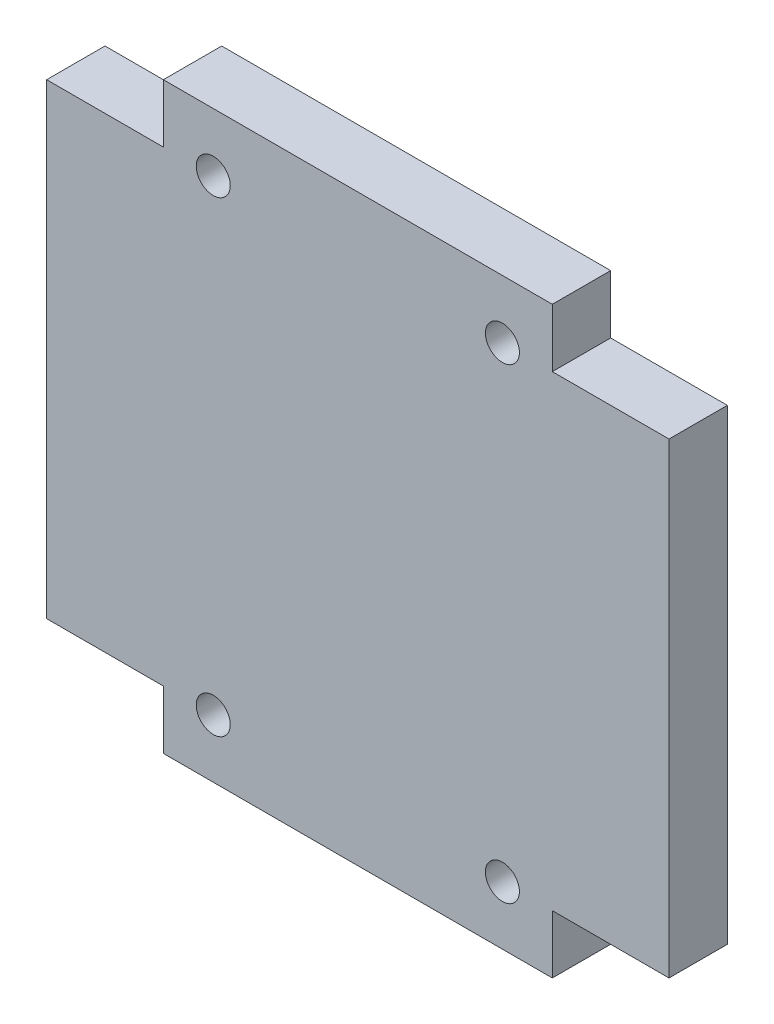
from build123d import *

# Parameters (mm, degrees)
BOSS_EXTRUDE1_DEPTH = 3
SKETCH2_R           = 0.875
CUT_EXTRUDE1_DEPTH  = 3


with BuildPart() as part:
    # Sketch1 → Boss-Extrude1 (new body)
    with BuildSketch(Plane.XY):
        Polygon((-211.342156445, -271.028662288), (-217.342156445, -271.028662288), (-217.342156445, -268.028662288), (-237.342156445, -268.028662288), (-237.342156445, -271.028662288), (-243.342156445, -271.028662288), (-243.342156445, -295.028662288), (-237.342156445, -295.028662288), (-237.342156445, -298.028662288), (-217.342156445, -298.028662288), (-217.342156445, -295.028662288), (-211.342156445, -295.028662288), align=None)
    extrude(amount=BOSS_EXTRUDE1_DEPTH)

    # Sketch2 → Cut-Extrude1 (cut)
    with BuildSketch(Plane.XY.offset(3)):
        with Locations((-219.908436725, -271.028662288)):
            Circle(SKETCH2_R)
        with Locations((-219.908436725, -295.028662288)):
            Circle(SKETCH2_R)
        with Locations((-234.775876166, -271.028662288)):
            Circle(SKETCH2_R)
        with Locations((-234.775876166, -295.028662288)):
            Circle(SKETCH2_R)
    extrude(amount=-CUT_EXTRUDE1_DEPTH, mode=Mode.SUBTRACT)


solid = part.part
